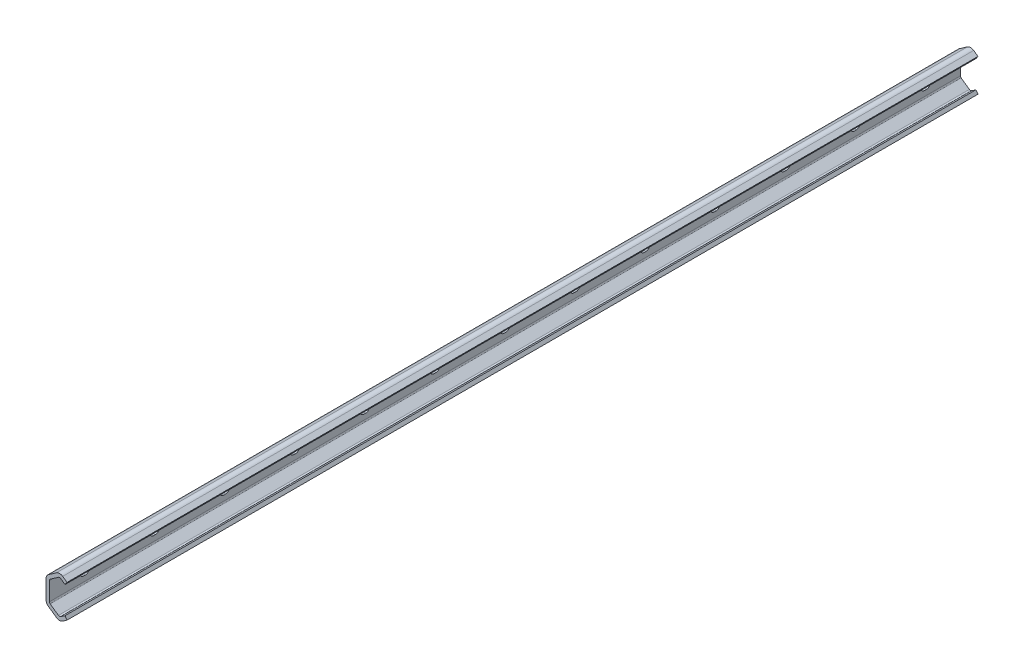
from build123d import *

# Parameters (mm, degrees)
EXTRUDE1_DEPTH  = 1040
EXTRUDE2_DEPTH  = 1041.452517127
LPATTERN1_COUNT = 13
LPATTERN1_PITCH = 80


with BuildPart() as part:
    # Sketch1 → Extrude1 (new body)
    with BuildSketch(Plane.XY):
        with BuildLine():
            Line((21.705694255, -15.401627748), (24, -18.678235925))
            Line((24, -18.678235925), (19.036236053, -22.153900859))
            ThreePointArc((19.036236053, -22.153900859), (15.5, -23.268871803), (11.963763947, -22.153900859))
            Line((11.963763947, -22.153900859), (3.371852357, -16.137779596))
            ThreePointArc((3.371852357, -16.137779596), (0.906121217, -13.750365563), (0, -10.44))
            Line((0, -10.44), (0, 10.44))
            ThreePointArc((0, 10.44), (0.906121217, 13.750365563), (3.371852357, 16.137779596))
            Line((3.371852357, 16.137779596), (11.963763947, 22.153900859))
            ThreePointArc((11.963763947, 22.153900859), (15.5, 23.268871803), (19.036236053, 22.153900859))
            Line((19.036236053, 22.153900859), (24, 18.678235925))
            Line((24, 18.678235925), (21.705694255, 15.401627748))
            Line((21.705694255, 15.401627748), (16.813992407, 18.826834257))
            ThreePointArc((16.813992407, 18.826834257), (15.5, 19.241134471), (14.186007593, 18.826834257))
            Line((14.186007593, 18.826834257), (4.730448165, 12.205980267))
            ThreePointArc((4.730448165, 12.205980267), (4.107613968, 11.429543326), (4, 10.44))
            Line((4, 10.44), (4, -10.44))
            ThreePointArc((4, -10.44), (4.189818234, -11.395541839), (4.730448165, -12.205980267))
            Line((4.730448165, -12.205980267), (14.186007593, -18.826834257))
            ThreePointArc((14.186007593, -18.826834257), (15.5, -19.241134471), (16.813992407, -18.826834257))
            Line((16.813992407, -18.826834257), (21.705694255, -15.401627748))
        make_face()
    extrude(amount=-EXTRUDE1_DEPTH)

    # Sketch2 → Extrude2 (cut, through all)
    with BuildSketch(Plane(origin=(4, 0, 0), x_dir=(0, 0, -1), z_dir=(1, 0, 0))):
        with BuildLine():
            Line((39, 4.5), (41, 4.5))
            ThreePointArc((41, 4.5), (45.5, 0), (41, -4.5))
            Line((41, -4.5), (39, -4.5))
            ThreePointArc((39, -4.5), (34.5, 0), (39, 4.5))
        make_face()
    extrude2 = extrude(amount=-EXTRUDE2_DEPTH, mode=Mode.SUBTRACT)

    # LPattern1: Extrude2 ×13
    with Locations(*[(0, 0, -i * LPATTERN1_PITCH) for i in range(1, LPATTERN1_COUNT)]):
        add(extrude2, mode=Mode.SUBTRACT)


solid = part.part
